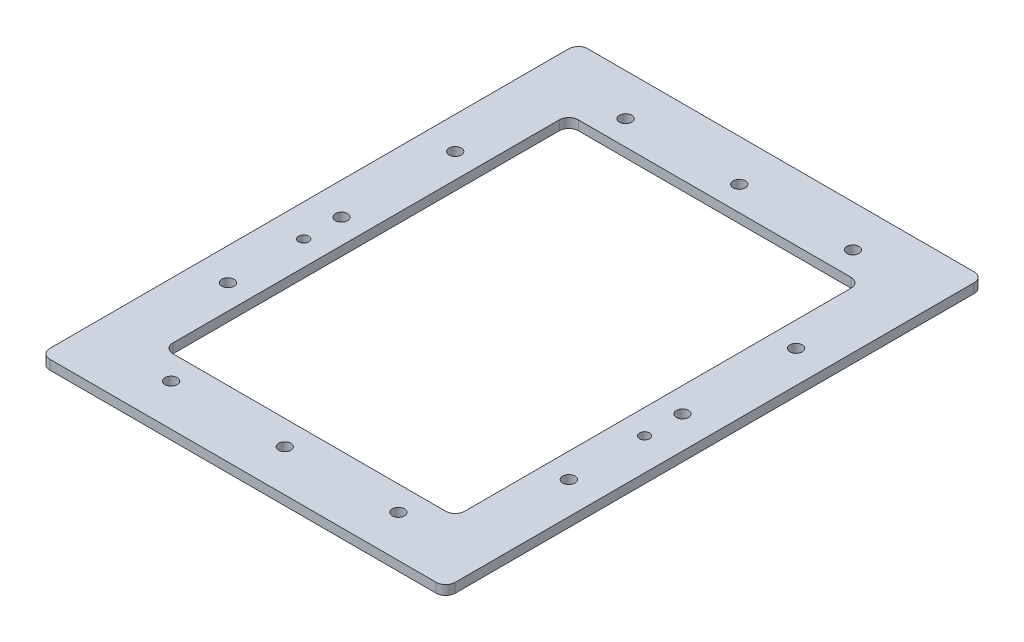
ISO-10303-21;
HEADER;
FILE_DESCRIPTION(('STEP AP214'),'2;1');
FILE_NAME('part.step','',(''),(''),'','','');
FILE_SCHEMA(('AUTOMOTIVE_DESIGN { 1 0 10303 214 1 1 1 1 }'));
ENDSEC;
DATA;
#1=APPLICATION_CONTEXT('core data for automotive mechanical design processes');
#2=APPLICATION_PROTOCOL_DEFINITION('international standard','automotive_design',2000,#1);
#3=PRODUCT_CONTEXT('',#1,'mechanical');
#4=PRODUCT('Part','Part','',(#3));
#5=PRODUCT_RELATED_PRODUCT_CATEGORY('part','',(#4));
#6=PRODUCT_DEFINITION_FORMATION('','',#4);
#7=PRODUCT_DEFINITION_CONTEXT('part definition',#1,'design');
#8=PRODUCT_DEFINITION('design','',#6,#7);
#9=PRODUCT_DEFINITION_SHAPE('','',#8);
#10=(LENGTH_UNIT() NAMED_UNIT(*) SI_UNIT(.MILLI.,.METRE.));
#11=(NAMED_UNIT(*) PLANE_ANGLE_UNIT() SI_UNIT($,.RADIAN.));
#12=(NAMED_UNIT(*) SI_UNIT($,.STERADIAN.) SOLID_ANGLE_UNIT());
#13=UNCERTAINTY_MEASURE_WITH_UNIT(LENGTH_MEASURE(1.E-05),#10,'distance_accuracy_value','');
#14=(GEOMETRIC_REPRESENTATION_CONTEXT(3) GLOBAL_UNCERTAINTY_ASSIGNED_CONTEXT((#13)) GLOBAL_UNIT_ASSIGNED_CONTEXT((#10,
#11,#12)) REPRESENTATION_CONTEXT('',''));
#15=CARTESIAN_POINT('',(0.,0.,0.));
#16=DIRECTION('',(0.,0.,1.));
#17=DIRECTION('',(1.,0.,0.));
#18=AXIS2_PLACEMENT_3D('',#15,#16,#17);
#19=CARTESIAN_POINT('',(135.89,-6.35,180.34));
#20=DIRECTION('',(1.,0.,0.));
#21=DIRECTION('',(0.,0.,-1.));
#22=AXIS2_PLACEMENT_3D('',#19,#20,#21);
#23=PLANE('',#22);
#24=DIRECTION('',(0.,0.,-1.));
#25=VECTOR('',#24,1.);
#26=CARTESIAN_POINT('',(135.89,0.,180.34));
#27=LINE('',#26,#25);
#28=CARTESIAN_POINT('',(135.89,0.,173.99));
#29=VERTEX_POINT('',#28);
#30=CARTESIAN_POINT('',(135.89,0.,-173.99));
#31=VERTEX_POINT('',#30);
#32=EDGE_CURVE('E228',#29,#31,#27,.T.);
#33=ORIENTED_EDGE('',*,*,#32,.F.);
#34=DIRECTION('',(0.,1.,0.));
#35=VECTOR('',#34,1.);
#36=CARTESIAN_POINT('',(135.89,-6.35,173.99));
#37=LINE('',#36,#35);
#38=CARTESIAN_POINT('',(135.89,-6.35,173.99));
#39=VERTEX_POINT('',#38);
#40=EDGE_CURVE('E305',#29,#39,#37,.F.);
#41=ORIENTED_EDGE('',*,*,#40,.T.);
#42=DIRECTION('',(0.,0.,-1.));
#43=VECTOR('',#42,1.);
#44=CARTESIAN_POINT('',(135.89,-6.35,180.34));
#45=LINE('',#44,#43);
#46=CARTESIAN_POINT('',(135.89,-6.35,-173.99));
#47=VERTEX_POINT('',#46);
#48=EDGE_CURVE('E212',#39,#47,#45,.T.);
#49=ORIENTED_EDGE('',*,*,#48,.T.);
#50=DIRECTION('',(0.,1.,0.));
#51=VECTOR('',#50,1.);
#52=CARTESIAN_POINT('',(135.89,-6.35,-173.99));
#53=LINE('',#52,#51);
#54=EDGE_CURVE('E301',#47,#31,#53,.T.);
#55=ORIENTED_EDGE('',*,*,#54,.T.);
#56=EDGE_LOOP('',(#33,#41,#49,#55));
#57=FACE_BOUND('',#56,.T.);
#58=ADVANCED_FACE('F44',(#57),#23,.T.);
#59=CARTESIAN_POINT('',(-135.89,-6.35,180.34));
#60=DIRECTION('',(0.,0.,1.));
#61=DIRECTION('',(1.,0.,0.));
#62=AXIS2_PLACEMENT_3D('',#59,#60,#61);
#63=PLANE('',#62);
#64=DIRECTION('',(1.,0.,0.));
#65=VECTOR('',#64,1.);
#66=CARTESIAN_POINT('',(-135.89,0.,180.34));
#67=LINE('',#66,#65);
#68=CARTESIAN_POINT('',(-129.54,0.,180.34));
#69=VERTEX_POINT('',#68);
#70=CARTESIAN_POINT('',(129.54,0.,180.34));
#71=VERTEX_POINT('',#70);
#72=EDGE_CURVE('E217',#69,#71,#67,.T.);
#73=ORIENTED_EDGE('',*,*,#72,.F.);
#74=DIRECTION('',(0.,1.,0.));
#75=VECTOR('',#74,1.);
#76=CARTESIAN_POINT('',(-129.54,-6.35,180.34));
#77=LINE('',#76,#75);
#78=CARTESIAN_POINT('',(-129.54,-6.35,180.34));
#79=VERTEX_POINT('',#78);
#80=EDGE_CURVE('E287',#69,#79,#77,.F.);
#81=ORIENTED_EDGE('',*,*,#80,.T.);
#82=DIRECTION('',(1.,0.,0.));
#83=VECTOR('',#82,1.);
#84=CARTESIAN_POINT('',(-135.89,-6.35,180.34));
#85=LINE('',#84,#83);
#86=CARTESIAN_POINT('',(129.54,-6.35,180.34));
#87=VERTEX_POINT('',#86);
#88=EDGE_CURVE('E224',#79,#87,#85,.T.);
#89=ORIENTED_EDGE('',*,*,#88,.T.);
#90=DIRECTION('',(0.,1.,0.));
#91=VECTOR('',#90,1.);
#92=CARTESIAN_POINT('',(129.54,-6.35,180.34));
#93=LINE('',#92,#91);
#94=EDGE_CURVE('E283',#87,#71,#93,.T.);
#95=ORIENTED_EDGE('',*,*,#94,.T.);
#96=EDGE_LOOP('',(#73,#81,#89,#95));
#97=FACE_BOUND('',#96,.T.);
#98=ADVANCED_FACE('F646',(#97),#63,.T.);
#99=CARTESIAN_POINT('',(-135.89,-6.35,180.34));
#100=DIRECTION('',(-1.,0.,0.));
#101=DIRECTION('',(0.,0.,1.));
#102=AXIS2_PLACEMENT_3D('',#99,#100,#101);
#103=PLANE('',#102);
#104=DIRECTION('',(0.,0.,1.));
#105=VECTOR('',#104,1.);
#106=CARTESIAN_POINT('',(-135.89,-6.35,180.34));
#107=LINE('',#106,#105);
#108=CARTESIAN_POINT('',(-135.89,-6.35,-173.99));
#109=VERTEX_POINT('',#108);
#110=CARTESIAN_POINT('',(-135.89,-6.35,173.99));
#111=VERTEX_POINT('',#110);
#112=EDGE_CURVE('E220',#109,#111,#107,.T.);
#113=ORIENTED_EDGE('',*,*,#112,.T.);
#114=DIRECTION('',(0.,1.,0.));
#115=VECTOR('',#114,1.);
#116=CARTESIAN_POINT('',(-135.89,-6.35,173.99));
#117=LINE('',#116,#115);
#118=CARTESIAN_POINT('',(-135.89,0.,173.99));
#119=VERTEX_POINT('',#118);
#120=EDGE_CURVE('E267',#111,#119,#117,.T.);
#121=ORIENTED_EDGE('',*,*,#120,.T.);
#122=DIRECTION('',(0.,0.,1.));
#123=VECTOR('',#122,1.);
#124=CARTESIAN_POINT('',(-135.89,0.,180.34));
#125=LINE('',#124,#123);
#126=CARTESIAN_POINT('',(-135.89,0.,-173.99));
#127=VERTEX_POINT('',#126);
#128=EDGE_CURVE('E236',#127,#119,#125,.T.);
#129=ORIENTED_EDGE('',*,*,#128,.F.);
#130=DIRECTION('',(0.,1.,0.));
#131=VECTOR('',#130,1.);
#132=CARTESIAN_POINT('',(-135.89,-6.35,-173.99));
#133=LINE('',#132,#131);
#134=EDGE_CURVE('E264',#127,#109,#133,.F.);
#135=ORIENTED_EDGE('',*,*,#134,.T.);
#136=EDGE_LOOP('',(#113,#121,#129,#135));
#137=FACE_BOUND('',#136,.T.);
#138=ADVANCED_FACE('F652',(#137),#103,.T.);
#139=CARTESIAN_POINT('',(-135.89,-6.35,-180.34));
#140=DIRECTION('',(0.,0.,-1.));
#141=DIRECTION('',(-1.,0.,0.));
#142=AXIS2_PLACEMENT_3D('',#139,#140,#141);
#143=PLANE('',#142);
#144=DIRECTION('',(-1.,0.,0.));
#145=VECTOR('',#144,1.);
#146=CARTESIAN_POINT('',(-135.89,0.,-180.34));
#147=LINE('',#146,#145);
#148=CARTESIAN_POINT('',(129.54,0.,-180.34));
#149=VERTEX_POINT('',#148);
#150=CARTESIAN_POINT('',(-129.54,0.,-180.34));
#151=VERTEX_POINT('',#150);
#152=EDGE_CURVE('E232',#149,#151,#147,.T.);
#153=ORIENTED_EDGE('',*,*,#152,.F.);
#154=DIRECTION('',(0.,1.,0.));
#155=VECTOR('',#154,1.);
#156=CARTESIAN_POINT('',(129.54,-6.35,-180.34));
#157=LINE('',#156,#155);
#158=CARTESIAN_POINT('',(129.54,-6.35,-180.34));
#159=VERTEX_POINT('',#158);
#160=EDGE_CURVE('E67',#149,#159,#157,.F.);
#161=ORIENTED_EDGE('',*,*,#160,.T.);
#162=DIRECTION('',(-1.,0.,0.));
#163=VECTOR('',#162,1.);
#164=CARTESIAN_POINT('',(-135.89,-6.35,-180.34));
#165=LINE('',#164,#163);
#166=CARTESIAN_POINT('',(-129.54,-6.35,-180.34));
#167=VERTEX_POINT('',#166);
#168=EDGE_CURVE('E216',#159,#167,#165,.T.);
#169=ORIENTED_EDGE('',*,*,#168,.T.);
#170=DIRECTION('',(0.,1.,0.));
#171=VECTOR('',#170,1.);
#172=CARTESIAN_POINT('',(-129.54,-6.35,-180.34));
#173=LINE('',#172,#171);
#174=EDGE_CURVE('E308',#167,#151,#173,.T.);
#175=ORIENTED_EDGE('',*,*,#174,.T.);
#176=EDGE_LOOP('',(#153,#161,#169,#175));
#177=FACE_BOUND('',#176,.T.);
#178=ADVANCED_FACE('F658',(#177),#143,.T.);
#179=CARTESIAN_POINT('',(0.,-6.35,0.));
#180=DIRECTION('',(0.,-1.,0.));
#181=DIRECTION('',(0.,0.,-1.));
#182=AXIS2_PLACEMENT_3D('',#179,#180,#181);
#183=PLANE('',#182);
#184=CARTESIAN_POINT('',(-114.3,-6.35,25.4));
#185=DIRECTION('',(0.,1.,0.));
#186=DIRECTION('',(0.,0.,1.));
#187=AXIS2_PLACEMENT_3D('',#184,#185,#186);
#188=CIRCLE('',#187,3.3782);
#189=CARTESIAN_POINT('',(-114.3,-6.35,28.7782));
#190=VERTEX_POINT('',#189);
#191=EDGE_CURVE('E583',#190,#190,#188,.T.);
#192=ORIENTED_EDGE('',*,*,#191,.T.);
#193=EDGE_LOOP('',(#192));
#194=FACE_BOUND('',#193,.T.);
#195=CARTESIAN_POINT('',(114.3,-6.35,25.4));
#196=DIRECTION('',(0.,1.,0.));
#197=DIRECTION('',(0.,0.,1.));
#198=AXIS2_PLACEMENT_3D('',#195,#196,#197);
#199=CIRCLE('',#198,3.3782);
#200=CARTESIAN_POINT('',(114.3,-6.35,28.7782));
#201=VERTEX_POINT('',#200);
#202=EDGE_CURVE('E571',#201,#201,#199,.T.);
#203=ORIENTED_EDGE('',*,*,#202,.T.);
#204=EDGE_LOOP('',(#203));
#205=FACE_BOUND('',#204,.T.);
#206=CARTESIAN_POINT('',(-76.2,-6.35,-152.4));
#207=DIRECTION('',(0.,1.,0.));
#208=DIRECTION('',(0.,0.,1.));
#209=AXIS2_PLACEMENT_3D('',#206,#207,#208);
#210=CIRCLE('',#209,4.1021);
#211=CARTESIAN_POINT('',(-76.2,-6.35,-148.2979));
#212=VERTEX_POINT('',#211);
#213=EDGE_CURVE('E559',#212,#212,#210,.T.);
#214=ORIENTED_EDGE('',*,*,#213,.T.);
#215=EDGE_LOOP('',(#214));
#216=FACE_BOUND('',#215,.T.);
#217=CARTESIAN_POINT('',(76.2,-6.35,-152.4));
#218=DIRECTION('',(0.,1.,0.));
#219=DIRECTION('',(0.,0.,1.));
#220=AXIS2_PLACEMENT_3D('',#217,#218,#219);
#221=CIRCLE('',#220,4.1021);
#222=CARTESIAN_POINT('',(76.2,-6.35,-148.2979));
#223=VERTEX_POINT('',#222);
#224=EDGE_CURVE('E547',#223,#223,#221,.T.);
#225=ORIENTED_EDGE('',*,*,#224,.T.);
#226=EDGE_LOOP('',(#225));
#227=FACE_BOUND('',#226,.T.);
#228=CARTESIAN_POINT('',(0.,-6.35,-152.4));
#229=DIRECTION('',(0.,1.,0.));
#230=DIRECTION('',(0.,0.,1.));
#231=AXIS2_PLACEMENT_3D('',#228,#229,#230);
#232=CIRCLE('',#231,4.1021);
#233=CARTESIAN_POINT('',(0.,-6.35,-148.2979));
#234=VERTEX_POINT('',#233);
#235=EDGE_CURVE('E535',#234,#234,#232,.T.);
#236=ORIENTED_EDGE('',*,*,#235,.T.);
#237=EDGE_LOOP('',(#236));
#238=FACE_BOUND('',#237,.T.);
#239=CARTESIAN_POINT('',(114.3,-6.35,0.));
#240=DIRECTION('',(0.,1.,0.));
#241=DIRECTION('',(0.,0.,1.));
#242=AXIS2_PLACEMENT_3D('',#239,#240,#241);
#243=CIRCLE('',#242,4.1021);
#244=CARTESIAN_POINT('',(114.3,-6.35,4.1021));
#245=VERTEX_POINT('',#244);
#246=EDGE_CURVE('E523',#245,#245,#243,.T.);
#247=ORIENTED_EDGE('',*,*,#246,.T.);
#248=EDGE_LOOP('',(#247));
#249=FACE_BOUND('',#248,.T.);
#250=CARTESIAN_POINT('',(114.3,-6.35,-76.2));
#251=DIRECTION('',(0.,1.,0.));
#252=DIRECTION('',(0.,0.,1.));
#253=AXIS2_PLACEMENT_3D('',#250,#251,#252);
#254=CIRCLE('',#253,4.1021);
#255=CARTESIAN_POINT('',(114.3,-6.35,-72.0979));
#256=VERTEX_POINT('',#255);
#257=EDGE_CURVE('E511',#256,#256,#254,.T.);
#258=ORIENTED_EDGE('',*,*,#257,.T.);
#259=EDGE_LOOP('',(#258));
#260=FACE_BOUND('',#259,.T.);
#261=CARTESIAN_POINT('',(114.3,-6.35,76.2));
#262=DIRECTION('',(0.,1.,0.));
#263=DIRECTION('',(0.,0.,1.));
#264=AXIS2_PLACEMENT_3D('',#261,#262,#263);
#265=CIRCLE('',#264,4.1021);
#266=CARTESIAN_POINT('',(114.3,-6.35,80.3021));
#267=VERTEX_POINT('',#266);
#268=EDGE_CURVE('E499',#267,#267,#265,.T.);
#269=ORIENTED_EDGE('',*,*,#268,.T.);
#270=EDGE_LOOP('',(#269));
#271=FACE_BOUND('',#270,.T.);
#272=CARTESIAN_POINT('',(-114.3,-6.35,0.));
#273=DIRECTION('',(0.,1.,0.));
#274=DIRECTION('',(0.,0.,1.));
#275=AXIS2_PLACEMENT_3D('',#272,#273,#274);
#276=CIRCLE('',#275,4.1021);
#277=CARTESIAN_POINT('',(-114.3,-6.35,4.10209999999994));
#278=VERTEX_POINT('',#277);
#279=EDGE_CURVE('E487',#278,#278,#276,.T.);
#280=ORIENTED_EDGE('',*,*,#279,.T.);
#281=EDGE_LOOP('',(#280));
#282=FACE_BOUND('',#281,.T.);
#283=CARTESIAN_POINT('',(-114.3,-6.35,-76.2));
#284=DIRECTION('',(0.,1.,0.));
#285=DIRECTION('',(0.,0.,1.));
#286=AXIS2_PLACEMENT_3D('',#283,#284,#285);
#287=CIRCLE('',#286,4.1021);
#288=CARTESIAN_POINT('',(-114.3,-6.35,-72.0979));
#289=VERTEX_POINT('',#288);
#290=EDGE_CURVE('E475',#289,#289,#287,.T.);
#291=ORIENTED_EDGE('',*,*,#290,.T.);
#292=EDGE_LOOP('',(#291));
#293=FACE_BOUND('',#292,.T.);
#294=CARTESIAN_POINT('',(-114.3,-6.35,76.2));
#295=DIRECTION('',(0.,1.,0.));
#296=DIRECTION('',(0.,0.,1.));
#297=AXIS2_PLACEMENT_3D('',#294,#295,#296);
#298=CIRCLE('',#297,4.1021);
#299=CARTESIAN_POINT('',(-114.3,-6.35,80.3021));
#300=VERTEX_POINT('',#299);
#301=EDGE_CURVE('E464',#300,#300,#298,.T.);
#302=ORIENTED_EDGE('',*,*,#301,.T.);
#303=EDGE_LOOP('',(#302));
#304=FACE_BOUND('',#303,.T.);
#305=CARTESIAN_POINT('',(0.,-6.35,152.4));
#306=DIRECTION('',(0.,1.,0.));
#307=DIRECTION('',(0.,0.,1.));
#308=AXIS2_PLACEMENT_3D('',#305,#306,#307);
#309=CIRCLE('',#308,4.1021);
#310=CARTESIAN_POINT('',(0.,-6.35,156.5021));
#311=VERTEX_POINT('',#310);
#312=EDGE_CURVE('E452',#311,#311,#309,.T.);
#313=ORIENTED_EDGE('',*,*,#312,.T.);
#314=EDGE_LOOP('',(#313));
#315=FACE_BOUND('',#314,.T.);
#316=CARTESIAN_POINT('',(-76.2,-6.35,152.4));
#317=DIRECTION('',(0.,1.,0.));
#318=DIRECTION('',(0.,0.,1.));
#319=AXIS2_PLACEMENT_3D('',#316,#317,#318);
#320=CIRCLE('',#319,4.1021);
#321=CARTESIAN_POINT('',(-76.2,-6.35,156.5021));
#322=VERTEX_POINT('',#321);
#323=EDGE_CURVE('E440',#322,#322,#320,.T.);
#324=ORIENTED_EDGE('',*,*,#323,.T.);
#325=EDGE_LOOP('',(#324));
#326=FACE_BOUND('',#325,.T.);
#327=CARTESIAN_POINT('',(76.2,-6.35,152.4));
#328=DIRECTION('',(0.,1.,0.));
#329=DIRECTION('',(0.,0.,1.));
#330=AXIS2_PLACEMENT_3D('',#327,#328,#329);
#331=CIRCLE('',#330,4.1021);
#332=CARTESIAN_POINT('',(76.2,-6.35,156.5021));
#333=VERTEX_POINT('',#332);
#334=EDGE_CURVE('E189',#333,#333,#331,.T.);
#335=ORIENTED_EDGE('',*,*,#334,.T.);
#336=EDGE_LOOP('',(#335));
#337=FACE_BOUND('',#336,.T.);
#338=DIRECTION('',(1.,0.,0.));
#339=VECTOR('',#338,1.);
#340=CARTESIAN_POINT('',(-97.79,-6.35,135.89));
#341=LINE('',#340,#339);
#342=CARTESIAN_POINT('',(-91.4400000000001,-6.35,135.89));
#343=VERTEX_POINT('',#342);
#344=CARTESIAN_POINT('',(91.4400000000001,-6.35,135.89));
#345=VERTEX_POINT('',#344);
#346=EDGE_CURVE('E203',#343,#345,#341,.T.);
#347=ORIENTED_EDGE('',*,*,#346,.T.);
#348=CARTESIAN_POINT('',(91.4400000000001,-6.35,129.54));
#349=DIRECTION('',(0.,-1.,0.));
#350=DIRECTION('',(0.,0.,-1.));
#351=AXIS2_PLACEMENT_3D('',#348,#349,#350);
#352=CIRCLE('',#351,6.35);
#353=CARTESIAN_POINT('',(97.7900000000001,-6.35,129.54));
#354=VERTEX_POINT('',#353);
#355=EDGE_CURVE('E170',#345,#354,#352,.F.);
#356=ORIENTED_EDGE('',*,*,#355,.T.);
#357=DIRECTION('',(0.,0.,-1.));
#358=VECTOR('',#357,1.);
#359=CARTESIAN_POINT('',(97.7900000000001,-6.35,135.89));
#360=LINE('',#359,#358);
#361=CARTESIAN_POINT('',(97.7900000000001,-6.35,-129.54));
#362=VERTEX_POINT('',#361);
#363=EDGE_CURVE('E179',#354,#362,#360,.T.);
#364=ORIENTED_EDGE('',*,*,#363,.T.);
#365=CARTESIAN_POINT('',(91.4400000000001,-6.35,-129.54));
#366=DIRECTION('',(0.,-1.,0.));
#367=DIRECTION('',(0.,0.,-1.));
#368=AXIS2_PLACEMENT_3D('',#365,#366,#367);
#369=CIRCLE('',#368,6.35);
#370=CARTESIAN_POINT('',(91.4400000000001,-6.35,-135.89));
#371=VERTEX_POINT('',#370);
#372=EDGE_CURVE('E11',#362,#371,#369,.F.);
#373=ORIENTED_EDGE('',*,*,#372,.T.);
#374=DIRECTION('',(-1.,0.,0.));
#375=VECTOR('',#374,1.);
#376=CARTESIAN_POINT('',(-97.7900000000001,-6.35,-135.89));
#377=LINE('',#376,#375);
#378=CARTESIAN_POINT('',(-91.4400000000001,-6.35,-135.89));
#379=VERTEX_POINT('',#378);
#380=EDGE_CURVE('E418',#371,#379,#377,.T.);
#381=ORIENTED_EDGE('',*,*,#380,.T.);
#382=CARTESIAN_POINT('',(-91.4400000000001,-6.35,-129.54));
#383=DIRECTION('',(0.,-1.,0.));
#384=DIRECTION('',(0.,0.,-1.));
#385=AXIS2_PLACEMENT_3D('',#382,#383,#384);
#386=CIRCLE('',#385,6.35);
#387=CARTESIAN_POINT('',(-97.7900000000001,-6.35,-129.54));
#388=VERTEX_POINT('',#387);
#389=EDGE_CURVE('E325',#379,#388,#386,.F.);
#390=ORIENTED_EDGE('',*,*,#389,.T.);
#391=DIRECTION('',(0.,0.,1.));
#392=VECTOR('',#391,1.);
#393=CARTESIAN_POINT('',(-97.79,-6.35,135.89));
#394=LINE('',#393,#392);
#395=CARTESIAN_POINT('',(-97.79,-6.35,129.54));
#396=VERTEX_POINT('',#395);
#397=EDGE_CURVE('E413',#388,#396,#394,.T.);
#398=ORIENTED_EDGE('',*,*,#397,.T.);
#399=CARTESIAN_POINT('',(-91.4400000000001,-6.35,129.54));
#400=DIRECTION('',(0.,-1.,0.));
#401=DIRECTION('',(0.,0.,-1.));
#402=AXIS2_PLACEMENT_3D('',#399,#400,#401);
#403=CIRCLE('',#402,6.35);
#404=EDGE_CURVE('E319',#396,#343,#403,.F.);
#405=ORIENTED_EDGE('',*,*,#404,.T.);
#406=EDGE_LOOP('',(#347,#356,#364,#373,#381,#390,#398,#405));
#407=FACE_BOUND('',#406,.T.);
#408=ORIENTED_EDGE('',*,*,#88,.F.);
#409=CARTESIAN_POINT('',(-129.54,-6.35,173.99));
#410=DIRECTION('',(0.,-1.,0.));
#411=DIRECTION('',(0.,0.,-1.));
#412=AXIS2_PLACEMENT_3D('',#409,#410,#411);
#413=CIRCLE('',#412,6.35);
#414=EDGE_CURVE('E298',#79,#111,#413,.T.);
#415=ORIENTED_EDGE('',*,*,#414,.T.);
#416=ORIENTED_EDGE('',*,*,#112,.F.);
#417=CARTESIAN_POINT('',(-129.54,-6.35,-173.99));
#418=DIRECTION('',(0.,-1.,0.));
#419=DIRECTION('',(0.,0.,-1.));
#420=AXIS2_PLACEMENT_3D('',#417,#418,#419);
#421=CIRCLE('',#420,6.35);
#422=EDGE_CURVE('E60',#109,#167,#421,.T.);
#423=ORIENTED_EDGE('',*,*,#422,.T.);
#424=ORIENTED_EDGE('',*,*,#168,.F.);
#425=CARTESIAN_POINT('',(129.54,-6.35,-173.99));
#426=DIRECTION('',(0.,-1.,0.));
#427=DIRECTION('',(0.,0.,-1.));
#428=AXIS2_PLACEMENT_3D('',#425,#426,#427);
#429=CIRCLE('',#428,6.35);
#430=EDGE_CURVE('E292',#159,#47,#429,.T.);
#431=ORIENTED_EDGE('',*,*,#430,.T.);
#432=ORIENTED_EDGE('',*,*,#48,.F.);
#433=CARTESIAN_POINT('',(129.54,-6.35,173.99));
#434=DIRECTION('',(0.,-1.,0.));
#435=DIRECTION('',(0.,0.,-1.));
#436=AXIS2_PLACEMENT_3D('',#433,#434,#435);
#437=CIRCLE('',#436,6.35);
#438=EDGE_CURVE('E295',#39,#87,#437,.T.);
#439=ORIENTED_EDGE('',*,*,#438,.T.);
#440=EDGE_LOOP('',(#408,#415,#416,#423,#424,#431,#432,#439));
#441=FACE_BOUND('',#440,.T.);
#442=ADVANCED_FACE('F601',(#194,#205,#216,#227,#238,#249,#260,#271,#282,#293,#304,#315,#326,
#337,#407,#441),#183,.T.);
#443=CARTESIAN_POINT('',(0.,0.,0.));
#444=DIRECTION('',(0.,-1.,0.));
#445=DIRECTION('',(0.,0.,-1.));
#446=AXIS2_PLACEMENT_3D('',#443,#444,#445);
#447=PLANE('',#446);
#448=CARTESIAN_POINT('',(-114.3,0.,25.4));
#449=DIRECTION('',(0.,1.,0.));
#450=DIRECTION('',(0.,0.,1.));
#451=AXIS2_PLACEMENT_3D('',#448,#449,#450);
#452=CIRCLE('',#451,3.3782);
#453=CARTESIAN_POINT('',(-114.3,0.,28.7782));
#454=VERTEX_POINT('',#453);
#455=EDGE_CURVE('E589',#454,#454,#452,.T.);
#456=ORIENTED_EDGE('',*,*,#455,.F.);
#457=EDGE_LOOP('',(#456));
#458=FACE_BOUND('',#457,.T.);
#459=CARTESIAN_POINT('',(114.3,0.,25.4));
#460=DIRECTION('',(0.,1.,0.));
#461=DIRECTION('',(0.,0.,1.));
#462=AXIS2_PLACEMENT_3D('',#459,#460,#461);
#463=CIRCLE('',#462,3.3782);
#464=CARTESIAN_POINT('',(114.3,0.,28.7782));
#465=VERTEX_POINT('',#464);
#466=EDGE_CURVE('E577',#465,#465,#463,.T.);
#467=ORIENTED_EDGE('',*,*,#466,.F.);
#468=EDGE_LOOP('',(#467));
#469=FACE_BOUND('',#468,.T.);
#470=CARTESIAN_POINT('',(-76.2,0.,-152.4));
#471=DIRECTION('',(0.,1.,0.));
#472=DIRECTION('',(0.,0.,1.));
#473=AXIS2_PLACEMENT_3D('',#470,#471,#472);
#474=CIRCLE('',#473,4.1021);
#475=CARTESIAN_POINT('',(-76.2,0.,-148.2979));
#476=VERTEX_POINT('',#475);
#477=EDGE_CURVE('E565',#476,#476,#474,.T.);
#478=ORIENTED_EDGE('',*,*,#477,.F.);
#479=EDGE_LOOP('',(#478));
#480=FACE_BOUND('',#479,.T.);
#481=CARTESIAN_POINT('',(76.2,0.,-152.4));
#482=DIRECTION('',(0.,1.,0.));
#483=DIRECTION('',(0.,0.,1.));
#484=AXIS2_PLACEMENT_3D('',#481,#482,#483);
#485=CIRCLE('',#484,4.1021);
#486=CARTESIAN_POINT('',(76.2,0.,-148.2979));
#487=VERTEX_POINT('',#486);
#488=EDGE_CURVE('E553',#487,#487,#485,.T.);
#489=ORIENTED_EDGE('',*,*,#488,.F.);
#490=EDGE_LOOP('',(#489));
#491=FACE_BOUND('',#490,.T.);
#492=CARTESIAN_POINT('',(0.,0.,-152.4));
#493=DIRECTION('',(0.,1.,0.));
#494=DIRECTION('',(0.,0.,1.));
#495=AXIS2_PLACEMENT_3D('',#492,#493,#494);
#496=CIRCLE('',#495,4.1021);
#497=CARTESIAN_POINT('',(0.,0.,-148.2979));
#498=VERTEX_POINT('',#497);
#499=EDGE_CURVE('E541',#498,#498,#496,.T.);
#500=ORIENTED_EDGE('',*,*,#499,.F.);
#501=EDGE_LOOP('',(#500));
#502=FACE_BOUND('',#501,.T.);
#503=CARTESIAN_POINT('',(114.3,0.,0.));
#504=DIRECTION('',(0.,1.,0.));
#505=DIRECTION('',(0.,0.,1.));
#506=AXIS2_PLACEMENT_3D('',#503,#504,#505);
#507=CIRCLE('',#506,4.1021);
#508=CARTESIAN_POINT('',(114.3,0.,4.1021));
#509=VERTEX_POINT('',#508);
#510=EDGE_CURVE('E529',#509,#509,#507,.T.);
#511=ORIENTED_EDGE('',*,*,#510,.F.);
#512=EDGE_LOOP('',(#511));
#513=FACE_BOUND('',#512,.T.);
#514=CARTESIAN_POINT('',(114.3,0.,-76.2));
#515=DIRECTION('',(0.,1.,0.));
#516=DIRECTION('',(0.,0.,1.));
#517=AXIS2_PLACEMENT_3D('',#514,#515,#516);
#518=CIRCLE('',#517,4.1021);
#519=CARTESIAN_POINT('',(114.3,0.,-72.0979));
#520=VERTEX_POINT('',#519);
#521=EDGE_CURVE('E517',#520,#520,#518,.T.);
#522=ORIENTED_EDGE('',*,*,#521,.F.);
#523=EDGE_LOOP('',(#522));
#524=FACE_BOUND('',#523,.T.);
#525=CARTESIAN_POINT('',(114.3,0.,76.2));
#526=DIRECTION('',(0.,1.,0.));
#527=DIRECTION('',(0.,0.,1.));
#528=AXIS2_PLACEMENT_3D('',#525,#526,#527);
#529=CIRCLE('',#528,4.1021);
#530=CARTESIAN_POINT('',(114.3,0.,80.3021));
#531=VERTEX_POINT('',#530);
#532=EDGE_CURVE('E505',#531,#531,#529,.T.);
#533=ORIENTED_EDGE('',*,*,#532,.F.);
#534=EDGE_LOOP('',(#533));
#535=FACE_BOUND('',#534,.T.);
#536=CARTESIAN_POINT('',(-114.3,0.,0.));
#537=DIRECTION('',(0.,1.,0.));
#538=DIRECTION('',(0.,0.,1.));
#539=AXIS2_PLACEMENT_3D('',#536,#537,#538);
#540=CIRCLE('',#539,4.1021);
#541=CARTESIAN_POINT('',(-114.3,0.,4.10209999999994));
#542=VERTEX_POINT('',#541);
#543=EDGE_CURVE('E493',#542,#542,#540,.T.);
#544=ORIENTED_EDGE('',*,*,#543,.F.);
#545=EDGE_LOOP('',(#544));
#546=FACE_BOUND('',#545,.T.);
#547=CARTESIAN_POINT('',(-114.3,0.,-76.2));
#548=DIRECTION('',(0.,1.,0.));
#549=DIRECTION('',(0.,0.,1.));
#550=AXIS2_PLACEMENT_3D('',#547,#548,#549);
#551=CIRCLE('',#550,4.1021);
#552=CARTESIAN_POINT('',(-114.3,0.,-72.0979));
#553=VERTEX_POINT('',#552);
#554=EDGE_CURVE('E481',#553,#553,#551,.T.);
#555=ORIENTED_EDGE('',*,*,#554,.F.);
#556=EDGE_LOOP('',(#555));
#557=FACE_BOUND('',#556,.T.);
#558=CARTESIAN_POINT('',(-114.3,0.,76.2));
#559=DIRECTION('',(0.,1.,0.));
#560=DIRECTION('',(0.,0.,1.));
#561=AXIS2_PLACEMENT_3D('',#558,#559,#560);
#562=CIRCLE('',#561,4.1021);
#563=CARTESIAN_POINT('',(-114.3,0.,80.3021));
#564=VERTEX_POINT('',#563);
#565=EDGE_CURVE('E469',#564,#564,#562,.T.);
#566=ORIENTED_EDGE('',*,*,#565,.F.);
#567=EDGE_LOOP('',(#566));
#568=FACE_BOUND('',#567,.T.);
#569=CARTESIAN_POINT('',(0.,0.,152.4));
#570=DIRECTION('',(0.,1.,0.));
#571=DIRECTION('',(0.,0.,1.));
#572=AXIS2_PLACEMENT_3D('',#569,#570,#571);
#573=CIRCLE('',#572,4.1021);
#574=CARTESIAN_POINT('',(0.,0.,156.5021));
#575=VERTEX_POINT('',#574);
#576=EDGE_CURVE('E458',#575,#575,#573,.T.);
#577=ORIENTED_EDGE('',*,*,#576,.F.);
#578=EDGE_LOOP('',(#577));
#579=FACE_BOUND('',#578,.T.);
#580=CARTESIAN_POINT('',(-76.2,0.,152.4));
#581=DIRECTION('',(0.,1.,0.));
#582=DIRECTION('',(0.,0.,1.));
#583=AXIS2_PLACEMENT_3D('',#580,#581,#582);
#584=CIRCLE('',#583,4.1021);
#585=CARTESIAN_POINT('',(-76.2,0.,156.5021));
#586=VERTEX_POINT('',#585);
#587=EDGE_CURVE('E446',#586,#586,#584,.T.);
#588=ORIENTED_EDGE('',*,*,#587,.F.);
#589=EDGE_LOOP('',(#588));
#590=FACE_BOUND('',#589,.T.);
#591=CARTESIAN_POINT('',(76.2,0.,152.4));
#592=DIRECTION('',(0.,1.,0.));
#593=DIRECTION('',(0.,0.,1.));
#594=AXIS2_PLACEMENT_3D('',#591,#592,#593);
#595=CIRCLE('',#594,4.1021);
#596=CARTESIAN_POINT('',(76.2,0.,156.5021));
#597=VERTEX_POINT('',#596);
#598=EDGE_CURVE('E200',#597,#597,#595,.T.);
#599=ORIENTED_EDGE('',*,*,#598,.F.);
#600=EDGE_LOOP('',(#599));
#601=FACE_BOUND('',#600,.T.);
#602=DIRECTION('',(-1.,0.,0.));
#603=VECTOR('',#602,1.);
#604=CARTESIAN_POINT('',(-97.7900000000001,0.,-135.89));
#605=LINE('',#604,#603);
#606=CARTESIAN_POINT('',(91.4400000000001,0.,-135.89));
#607=VERTEX_POINT('',#606);
#608=CARTESIAN_POINT('',(-91.4400000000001,0.,-135.89));
#609=VERTEX_POINT('',#608);
#610=EDGE_CURVE('E188',#607,#609,#605,.T.);
#611=ORIENTED_EDGE('',*,*,#610,.F.);
#612=CARTESIAN_POINT('',(91.4400000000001,0.,-129.54));
#613=DIRECTION('',(0.,-1.,0.));
#614=DIRECTION('',(0.,0.,-1.));
#615=AXIS2_PLACEMENT_3D('',#612,#613,#614);
#616=CIRCLE('',#615,6.35);
#617=CARTESIAN_POINT('',(97.7900000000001,0.,-129.54));
#618=VERTEX_POINT('',#617);
#619=EDGE_CURVE('E53',#607,#618,#616,.T.);
#620=ORIENTED_EDGE('',*,*,#619,.T.);
#621=DIRECTION('',(0.,0.,-1.));
#622=VECTOR('',#621,1.);
#623=CARTESIAN_POINT('',(97.7900000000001,0.,135.89));
#624=LINE('',#623,#622);
#625=CARTESIAN_POINT('',(97.7900000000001,0.,129.54));
#626=VERTEX_POINT('',#625);
#627=EDGE_CURVE('E176',#626,#618,#624,.T.);
#628=ORIENTED_EDGE('',*,*,#627,.F.);
#629=CARTESIAN_POINT('',(91.4400000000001,0.,129.54));
#630=DIRECTION('',(0.,-1.,0.));
#631=DIRECTION('',(0.,0.,-1.));
#632=AXIS2_PLACEMENT_3D('',#629,#630,#631);
#633=CIRCLE('',#632,6.35);
#634=CARTESIAN_POINT('',(91.4400000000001,0.,135.89));
#635=VERTEX_POINT('',#634);
#636=EDGE_CURVE('E159',#626,#635,#633,.T.);
#637=ORIENTED_EDGE('',*,*,#636,.T.);
#638=DIRECTION('',(1.,0.,0.));
#639=VECTOR('',#638,1.);
#640=CARTESIAN_POINT('',(-97.79,0.,135.89));
#641=LINE('',#640,#639);
#642=CARTESIAN_POINT('',(-91.4400000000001,0.,135.89));
#643=VERTEX_POINT('',#642);
#644=EDGE_CURVE('E209',#643,#635,#641,.T.);
#645=ORIENTED_EDGE('',*,*,#644,.F.);
#646=CARTESIAN_POINT('',(-91.4400000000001,0.,129.54));
#647=DIRECTION('',(0.,-1.,0.));
#648=DIRECTION('',(0.,0.,-1.));
#649=AXIS2_PLACEMENT_3D('',#646,#647,#648);
#650=CIRCLE('',#649,6.35);
#651=CARTESIAN_POINT('',(-97.79,0.,129.54));
#652=VERTEX_POINT('',#651);
#653=EDGE_CURVE('E316',#643,#652,#650,.T.);
#654=ORIENTED_EDGE('',*,*,#653,.T.);
#655=DIRECTION('',(0.,0.,1.));
#656=VECTOR('',#655,1.);
#657=CARTESIAN_POINT('',(-97.79,0.,135.89));
#658=LINE('',#657,#656);
#659=CARTESIAN_POINT('',(-97.7900000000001,0.,-129.54));
#660=VERTEX_POINT('',#659);
#661=EDGE_CURVE('E196',#660,#652,#658,.T.);
#662=ORIENTED_EDGE('',*,*,#661,.F.);
#663=CARTESIAN_POINT('',(-91.4400000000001,0.,-129.54));
#664=DIRECTION('',(0.,-1.,0.));
#665=DIRECTION('',(0.,0.,-1.));
#666=AXIS2_PLACEMENT_3D('',#663,#664,#665);
#667=CIRCLE('',#666,6.35);
#668=EDGE_CURVE('E322',#660,#609,#667,.T.);
#669=ORIENTED_EDGE('',*,*,#668,.T.);
#670=EDGE_LOOP('',(#611,#620,#628,#637,#645,#654,#662,#669));
#671=FACE_BOUND('',#670,.T.);
#672=ORIENTED_EDGE('',*,*,#128,.T.);
#673=CARTESIAN_POINT('',(-129.54,0.,173.99));
#674=DIRECTION('',(0.,-1.,0.));
#675=DIRECTION('',(0.,0.,-1.));
#676=AXIS2_PLACEMENT_3D('',#673,#674,#675);
#677=CIRCLE('',#676,6.35);
#678=EDGE_CURVE('E280',#119,#69,#677,.F.);
#679=ORIENTED_EDGE('',*,*,#678,.T.);
#680=ORIENTED_EDGE('',*,*,#72,.T.);
#681=CARTESIAN_POINT('',(129.54,0.,173.99));
#682=DIRECTION('',(0.,-1.,0.));
#683=DIRECTION('',(0.,0.,-1.));
#684=AXIS2_PLACEMENT_3D('',#681,#682,#683);
#685=CIRCLE('',#684,6.35);
#686=EDGE_CURVE('E277',#71,#29,#685,.F.);
#687=ORIENTED_EDGE('',*,*,#686,.T.);
#688=ORIENTED_EDGE('',*,*,#32,.T.);
#689=CARTESIAN_POINT('',(129.54,0.,-173.99));
#690=DIRECTION('',(0.,-1.,0.));
#691=DIRECTION('',(0.,0.,-1.));
#692=AXIS2_PLACEMENT_3D('',#689,#690,#691);
#693=CIRCLE('',#692,6.35);
#694=EDGE_CURVE('E274',#31,#149,#693,.F.);
#695=ORIENTED_EDGE('',*,*,#694,.T.);
#696=ORIENTED_EDGE('',*,*,#152,.T.);
#697=CARTESIAN_POINT('',(-129.54,0.,-173.99));
#698=DIRECTION('',(0.,-1.,0.));
#699=DIRECTION('',(0.,0.,-1.));
#700=AXIS2_PLACEMENT_3D('',#697,#698,#699);
#701=CIRCLE('',#700,6.35);
#702=EDGE_CURVE('E271',#151,#127,#701,.F.);
#703=ORIENTED_EDGE('',*,*,#702,.T.);
#704=EDGE_LOOP('',(#672,#679,#680,#687,#688,#695,#696,#703));
#705=FACE_BOUND('',#704,.T.);
#706=ADVANCED_FACE('F185',(#458,#469,#480,#491,#502,#513,#524,#535,#546,#557,#568,#579,#590,
#601,#671,#705),#447,.F.);
#707=CARTESIAN_POINT('',(97.7900000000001,-6.35,135.89));
#708=DIRECTION('',(1.,0.,0.));
#709=DIRECTION('',(0.,0.,-1.));
#710=AXIS2_PLACEMENT_3D('',#707,#708,#709);
#711=PLANE('',#710);
#712=ORIENTED_EDGE('',*,*,#363,.F.);
#713=DIRECTION('',(0.,1.,0.));
#714=VECTOR('',#713,1.);
#715=CARTESIAN_POINT('',(97.7900000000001,0.,129.54));
#716=LINE('',#715,#714);
#717=EDGE_CURVE('E163',#354,#626,#716,.T.);
#718=ORIENTED_EDGE('',*,*,#717,.T.);
#719=ORIENTED_EDGE('',*,*,#627,.T.);
#720=DIRECTION('',(0.,1.,0.));
#721=VECTOR('',#720,1.);
#722=CARTESIAN_POINT('',(97.7900000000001,-6.35,-129.54));
#723=LINE('',#722,#721);
#724=EDGE_CURVE('E182',#618,#362,#723,.F.);
#725=ORIENTED_EDGE('',*,*,#724,.T.);
#726=EDGE_LOOP('',(#712,#718,#719,#725));
#727=FACE_BOUND('',#726,.T.);
#728=ADVANCED_FACE('F175',(#727),#711,.F.);
#729=CARTESIAN_POINT('',(-97.79,-6.35,135.89));
#730=DIRECTION('',(0.,0.,1.));
#731=DIRECTION('',(1.,0.,0.));
#732=AXIS2_PLACEMENT_3D('',#729,#730,#731);
#733=PLANE('',#732);
#734=ORIENTED_EDGE('',*,*,#644,.T.);
#735=DIRECTION('',(0.,1.,0.));
#736=VECTOR('',#735,1.);
#737=CARTESIAN_POINT('',(91.4400000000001,-6.35,135.89));
#738=LINE('',#737,#736);
#739=EDGE_CURVE('E164',#635,#345,#738,.F.);
#740=ORIENTED_EDGE('',*,*,#739,.T.);
#741=ORIENTED_EDGE('',*,*,#346,.F.);
#742=DIRECTION('',(0.,1.,0.));
#743=VECTOR('',#742,1.);
#744=CARTESIAN_POINT('',(-91.4400000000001,0.,135.89));
#745=LINE('',#744,#743);
#746=EDGE_CURVE('E181',#343,#643,#745,.T.);
#747=ORIENTED_EDGE('',*,*,#746,.T.);
#748=EDGE_LOOP('',(#734,#740,#741,#747));
#749=FACE_BOUND('',#748,.T.);
#750=ADVANCED_FACE('F713',(#749),#733,.F.);
#751=CARTESIAN_POINT('',(-97.79,-6.35,135.89));
#752=DIRECTION('',(-1.,0.,0.));
#753=DIRECTION('',(0.,0.,1.));
#754=AXIS2_PLACEMENT_3D('',#751,#752,#753);
#755=PLANE('',#754);
#756=ORIENTED_EDGE('',*,*,#661,.T.);
#757=DIRECTION('',(0.,1.,0.));
#758=VECTOR('',#757,1.);
#759=CARTESIAN_POINT('',(-97.79,-6.35,129.54));
#760=LINE('',#759,#758);
#761=EDGE_CURVE('E254',#652,#396,#760,.F.);
#762=ORIENTED_EDGE('',*,*,#761,.T.);
#763=ORIENTED_EDGE('',*,*,#397,.F.);
#764=DIRECTION('',(0.,1.,0.));
#765=VECTOR('',#764,1.);
#766=CARTESIAN_POINT('',(-97.7900000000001,0.,-129.54));
#767=LINE('',#766,#765);
#768=EDGE_CURVE('E250',#388,#660,#767,.T.);
#769=ORIENTED_EDGE('',*,*,#768,.T.);
#770=EDGE_LOOP('',(#756,#762,#763,#769));
#771=FACE_BOUND('',#770,.T.);
#772=ADVANCED_FACE('F716',(#771),#755,.F.);
#773=CARTESIAN_POINT('',(-97.7900000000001,-6.35,-135.89));
#774=DIRECTION('',(0.,0.,-1.));
#775=DIRECTION('',(-1.,0.,0.));
#776=AXIS2_PLACEMENT_3D('',#773,#774,#775);
#777=PLANE('',#776);
#778=ORIENTED_EDGE('',*,*,#610,.T.);
#779=DIRECTION('',(0.,1.,0.));
#780=VECTOR('',#779,1.);
#781=CARTESIAN_POINT('',(-91.4400000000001,-6.35,-135.89));
#782=LINE('',#781,#780);
#783=EDGE_CURVE('E261',#609,#379,#782,.F.);
#784=ORIENTED_EDGE('',*,*,#783,.T.);
#785=ORIENTED_EDGE('',*,*,#380,.F.);
#786=DIRECTION('',(0.,1.,0.));
#787=VECTOR('',#786,1.);
#788=CARTESIAN_POINT('',(91.4400000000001,0.,-135.89));
#789=LINE('',#788,#787);
#790=EDGE_CURVE('E257',#371,#607,#789,.T.);
#791=ORIENTED_EDGE('',*,*,#790,.T.);
#792=EDGE_LOOP('',(#778,#784,#785,#791));
#793=FACE_BOUND('',#792,.T.);
#794=ADVANCED_FACE('F663',(#793),#777,.F.);
#795=CARTESIAN_POINT('',(91.4400000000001,-6.35,129.54));
#796=DIRECTION('',(0.,-1.,0.));
#797=DIRECTION('',(0.,0.,-1.));
#798=AXIS2_PLACEMENT_3D('',#795,#796,#797);
#799=CYLINDRICAL_SURFACE('',#798,6.35);
#800=ORIENTED_EDGE('',*,*,#355,.F.);
#801=ORIENTED_EDGE('',*,*,#739,.F.);
#802=ORIENTED_EDGE('',*,*,#636,.F.);
#803=ORIENTED_EDGE('',*,*,#717,.F.);
#804=EDGE_LOOP('',(#800,#801,#802,#803));
#805=FACE_BOUND('',#804,.T.);
#806=ADVANCED_FACE('F162',(#805),#799,.F.);
#807=CARTESIAN_POINT('',(-91.4400000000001,-6.35,129.54));
#808=DIRECTION('',(0.,-1.,0.));
#809=DIRECTION('',(0.,0.,-1.));
#810=AXIS2_PLACEMENT_3D('',#807,#808,#809);
#811=CYLINDRICAL_SURFACE('',#810,6.35);
#812=ORIENTED_EDGE('',*,*,#404,.F.);
#813=ORIENTED_EDGE('',*,*,#761,.F.);
#814=ORIENTED_EDGE('',*,*,#653,.F.);
#815=ORIENTED_EDGE('',*,*,#746,.F.);
#816=EDGE_LOOP('',(#812,#813,#814,#815));
#817=FACE_BOUND('',#816,.T.);
#818=ADVANCED_FACE('F662',(#817),#811,.F.);
#819=CARTESIAN_POINT('',(-91.4400000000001,-6.35,-129.54));
#820=DIRECTION('',(0.,-1.,0.));
#821=DIRECTION('',(0.,0.,-1.));
#822=AXIS2_PLACEMENT_3D('',#819,#820,#821);
#823=CYLINDRICAL_SURFACE('',#822,6.35);
#824=ORIENTED_EDGE('',*,*,#389,.F.);
#825=ORIENTED_EDGE('',*,*,#783,.F.);
#826=ORIENTED_EDGE('',*,*,#668,.F.);
#827=ORIENTED_EDGE('',*,*,#768,.F.);
#828=EDGE_LOOP('',(#824,#825,#826,#827));
#829=FACE_BOUND('',#828,.T.);
#830=ADVANCED_FACE('F666',(#829),#823,.F.);
#831=CARTESIAN_POINT('',(91.4400000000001,-6.35,-129.54));
#832=DIRECTION('',(0.,-1.,0.));
#833=DIRECTION('',(0.,0.,-1.));
#834=AXIS2_PLACEMENT_3D('',#831,#832,#833);
#835=CYLINDRICAL_SURFACE('',#834,6.35);
#836=ORIENTED_EDGE('',*,*,#372,.F.);
#837=ORIENTED_EDGE('',*,*,#724,.F.);
#838=ORIENTED_EDGE('',*,*,#619,.F.);
#839=ORIENTED_EDGE('',*,*,#790,.F.);
#840=EDGE_LOOP('',(#836,#837,#838,#839));
#841=FACE_BOUND('',#840,.T.);
#842=ADVANCED_FACE('F670',(#841),#835,.F.);
#843=CARTESIAN_POINT('',(-129.54,-6.35,173.99));
#844=DIRECTION('',(0.,1.,0.));
#845=DIRECTION('',(0.,0.,1.));
#846=AXIS2_PLACEMENT_3D('',#843,#844,#845);
#847=CYLINDRICAL_SURFACE('',#846,6.35);
#848=ORIENTED_EDGE('',*,*,#414,.F.);
#849=ORIENTED_EDGE('',*,*,#80,.F.);
#850=ORIENTED_EDGE('',*,*,#678,.F.);
#851=ORIENTED_EDGE('',*,*,#120,.F.);
#852=EDGE_LOOP('',(#848,#849,#850,#851));
#853=FACE_BOUND('',#852,.T.);
#854=ADVANCED_FACE('F674',(#853),#847,.T.);
#855=CARTESIAN_POINT('',(129.54,-6.35,173.99));
#856=DIRECTION('',(0.,1.,0.));
#857=DIRECTION('',(0.,0.,1.));
#858=AXIS2_PLACEMENT_3D('',#855,#856,#857);
#859=CYLINDRICAL_SURFACE('',#858,6.35);
#860=ORIENTED_EDGE('',*,*,#438,.F.);
#861=ORIENTED_EDGE('',*,*,#40,.F.);
#862=ORIENTED_EDGE('',*,*,#686,.F.);
#863=ORIENTED_EDGE('',*,*,#94,.F.);
#864=EDGE_LOOP('',(#860,#861,#862,#863));
#865=FACE_BOUND('',#864,.T.);
#866=ADVANCED_FACE('F678',(#865),#859,.T.);
#867=CARTESIAN_POINT('',(129.54,-6.35,-173.99));
#868=DIRECTION('',(0.,1.,0.));
#869=DIRECTION('',(0.,0.,1.));
#870=AXIS2_PLACEMENT_3D('',#867,#868,#869);
#871=CYLINDRICAL_SURFACE('',#870,6.35);
#872=ORIENTED_EDGE('',*,*,#430,.F.);
#873=ORIENTED_EDGE('',*,*,#160,.F.);
#874=ORIENTED_EDGE('',*,*,#694,.F.);
#875=ORIENTED_EDGE('',*,*,#54,.F.);
#876=EDGE_LOOP('',(#872,#873,#874,#875));
#877=FACE_BOUND('',#876,.T.);
#878=ADVANCED_FACE('F641',(#877),#871,.T.);
#879=CARTESIAN_POINT('',(-129.54,-6.35,-173.99));
#880=DIRECTION('',(0.,1.,0.));
#881=DIRECTION('',(0.,0.,1.));
#882=AXIS2_PLACEMENT_3D('',#879,#880,#881);
#883=CYLINDRICAL_SURFACE('',#882,6.35);
#884=ORIENTED_EDGE('',*,*,#422,.F.);
#885=ORIENTED_EDGE('',*,*,#134,.F.);
#886=ORIENTED_EDGE('',*,*,#702,.F.);
#887=ORIENTED_EDGE('',*,*,#174,.F.);
#888=EDGE_LOOP('',(#884,#885,#886,#887));
#889=FACE_BOUND('',#888,.T.);
#890=ADVANCED_FACE('F46',(#889),#883,.T.);
#891=CARTESIAN_POINT('',(76.2,0.,152.4));
#892=DIRECTION('',(0.,1.,0.));
#893=DIRECTION('',(0.,0.,1.));
#894=AXIS2_PLACEMENT_3D('',#891,#892,#893);
#895=CYLINDRICAL_SURFACE('',#894,4.1021);
#896=ORIENTED_EDGE('',*,*,#334,.F.);
#897=EDGE_LOOP('',(#896));
#898=FACE_BOUND('',#897,.T.);
#899=ORIENTED_EDGE('',*,*,#598,.T.);
#900=EDGE_LOOP('',(#899));
#901=FACE_BOUND('',#900,.T.);
#902=ADVANCED_FACE('F629',(#898,#901),#895,.F.);
#903=CARTESIAN_POINT('',(-76.2,0.,152.4));
#904=DIRECTION('',(0.,1.,0.));
#905=DIRECTION('',(0.,0.,1.));
#906=AXIS2_PLACEMENT_3D('',#903,#904,#905);
#907=CYLINDRICAL_SURFACE('',#906,4.1021);
#908=ORIENTED_EDGE('',*,*,#323,.F.);
#909=EDGE_LOOP('',(#908));
#910=FACE_BOUND('',#909,.T.);
#911=ORIENTED_EDGE('',*,*,#587,.T.);
#912=EDGE_LOOP('',(#911));
#913=FACE_BOUND('',#912,.T.);
#914=ADVANCED_FACE('F631',(#910,#913),#907,.F.);
#915=CARTESIAN_POINT('',(0.,0.,152.4));
#916=DIRECTION('',(0.,1.,0.));
#917=DIRECTION('',(0.,0.,1.));
#918=AXIS2_PLACEMENT_3D('',#915,#916,#917);
#919=CYLINDRICAL_SURFACE('',#918,4.1021);
#920=ORIENTED_EDGE('',*,*,#312,.F.);
#921=EDGE_LOOP('',(#920));
#922=FACE_BOUND('',#921,.T.);
#923=ORIENTED_EDGE('',*,*,#576,.T.);
#924=EDGE_LOOP('',(#923));
#925=FACE_BOUND('',#924,.T.);
#926=ADVANCED_FACE('F638',(#922,#925),#919,.F.);
#927=CARTESIAN_POINT('',(-114.3,0.,76.2));
#928=DIRECTION('',(0.,1.,0.));
#929=DIRECTION('',(0.,0.,1.));
#930=AXIS2_PLACEMENT_3D('',#927,#928,#929);
#931=CYLINDRICAL_SURFACE('',#930,4.1021);
#932=ORIENTED_EDGE('',*,*,#301,.F.);
#933=EDGE_LOOP('',(#932));
#934=FACE_BOUND('',#933,.T.);
#935=ORIENTED_EDGE('',*,*,#565,.T.);
#936=EDGE_LOOP('',(#935));
#937=FACE_BOUND('',#936,.T.);
#938=ADVANCED_FACE('F787',(#934,#937),#931,.F.);
#939=CARTESIAN_POINT('',(-114.3,0.,-76.2));
#940=DIRECTION('',(0.,1.,0.));
#941=DIRECTION('',(0.,0.,1.));
#942=AXIS2_PLACEMENT_3D('',#939,#940,#941);
#943=CYLINDRICAL_SURFACE('',#942,4.1021);
#944=ORIENTED_EDGE('',*,*,#290,.F.);
#945=EDGE_LOOP('',(#944));
#946=FACE_BOUND('',#945,.T.);
#947=ORIENTED_EDGE('',*,*,#554,.T.);
#948=EDGE_LOOP('',(#947));
#949=FACE_BOUND('',#948,.T.);
#950=ADVANCED_FACE('F792',(#946,#949),#943,.F.);
#951=CARTESIAN_POINT('',(-114.3,0.,0.));
#952=DIRECTION('',(0.,1.,0.));
#953=DIRECTION('',(0.,0.,1.));
#954=AXIS2_PLACEMENT_3D('',#951,#952,#953);
#955=CYLINDRICAL_SURFACE('',#954,4.1021);
#956=ORIENTED_EDGE('',*,*,#279,.F.);
#957=EDGE_LOOP('',(#956));
#958=FACE_BOUND('',#957,.T.);
#959=ORIENTED_EDGE('',*,*,#543,.T.);
#960=EDGE_LOOP('',(#959));
#961=FACE_BOUND('',#960,.T.);
#962=ADVANCED_FACE('F804',(#958,#961),#955,.F.);
#963=CARTESIAN_POINT('',(114.3,0.,76.2));
#964=DIRECTION('',(0.,1.,0.));
#965=DIRECTION('',(0.,0.,1.));
#966=AXIS2_PLACEMENT_3D('',#963,#964,#965);
#967=CYLINDRICAL_SURFACE('',#966,4.1021);
#968=ORIENTED_EDGE('',*,*,#268,.F.);
#969=EDGE_LOOP('',(#968));
#970=FACE_BOUND('',#969,.T.);
#971=ORIENTED_EDGE('',*,*,#532,.T.);
#972=EDGE_LOOP('',(#971));
#973=FACE_BOUND('',#972,.T.);
#974=ADVANCED_FACE('F814',(#970,#973),#967,.F.);
#975=CARTESIAN_POINT('',(114.3,0.,-76.2));
#976=DIRECTION('',(0.,1.,0.));
#977=DIRECTION('',(0.,0.,1.));
#978=AXIS2_PLACEMENT_3D('',#975,#976,#977);
#979=CYLINDRICAL_SURFACE('',#978,4.1021);
#980=ORIENTED_EDGE('',*,*,#257,.F.);
#981=EDGE_LOOP('',(#980));
#982=FACE_BOUND('',#981,.T.);
#983=ORIENTED_EDGE('',*,*,#521,.T.);
#984=EDGE_LOOP('',(#983));
#985=FACE_BOUND('',#984,.T.);
#986=ADVANCED_FACE('F824',(#982,#985),#979,.F.);
#987=CARTESIAN_POINT('',(114.3,0.,0.));
#988=DIRECTION('',(0.,1.,0.));
#989=DIRECTION('',(0.,0.,1.));
#990=AXIS2_PLACEMENT_3D('',#987,#988,#989);
#991=CYLINDRICAL_SURFACE('',#990,4.1021);
#992=ORIENTED_EDGE('',*,*,#246,.F.);
#993=EDGE_LOOP('',(#992));
#994=FACE_BOUND('',#993,.T.);
#995=ORIENTED_EDGE('',*,*,#510,.T.);
#996=EDGE_LOOP('',(#995));
#997=FACE_BOUND('',#996,.T.);
#998=ADVANCED_FACE('F834',(#994,#997),#991,.F.);
#999=CARTESIAN_POINT('',(0.,0.,-152.4));
#1000=DIRECTION('',(0.,1.,0.));
#1001=DIRECTION('',(0.,0.,1.));
#1002=AXIS2_PLACEMENT_3D('',#999,#1000,#1001);
#1003=CYLINDRICAL_SURFACE('',#1002,4.1021);
#1004=ORIENTED_EDGE('',*,*,#235,.F.);
#1005=EDGE_LOOP('',(#1004));
#1006=FACE_BOUND('',#1005,.T.);
#1007=ORIENTED_EDGE('',*,*,#499,.T.);
#1008=EDGE_LOOP('',(#1007));
#1009=FACE_BOUND('',#1008,.T.);
#1010=ADVANCED_FACE('F844',(#1006,#1009),#1003,.F.);
#1011=CARTESIAN_POINT('',(76.2,0.,-152.4));
#1012=DIRECTION('',(0.,1.,0.));
#1013=DIRECTION('',(0.,0.,1.));
#1014=AXIS2_PLACEMENT_3D('',#1011,#1012,#1013);
#1015=CYLINDRICAL_SURFACE('',#1014,4.1021);
#1016=ORIENTED_EDGE('',*,*,#224,.F.);
#1017=EDGE_LOOP('',(#1016));
#1018=FACE_BOUND('',#1017,.T.);
#1019=ORIENTED_EDGE('',*,*,#488,.T.);
#1020=EDGE_LOOP('',(#1019));
#1021=FACE_BOUND('',#1020,.T.);
#1022=ADVANCED_FACE('F854',(#1018,#1021),#1015,.F.);
#1023=CARTESIAN_POINT('',(-76.2,0.,-152.4));
#1024=DIRECTION('',(0.,1.,0.));
#1025=DIRECTION('',(0.,0.,1.));
#1026=AXIS2_PLACEMENT_3D('',#1023,#1024,#1025);
#1027=CYLINDRICAL_SURFACE('',#1026,4.1021);
#1028=ORIENTED_EDGE('',*,*,#213,.F.);
#1029=EDGE_LOOP('',(#1028));
#1030=FACE_BOUND('',#1029,.T.);
#1031=ORIENTED_EDGE('',*,*,#477,.T.);
#1032=EDGE_LOOP('',(#1031));
#1033=FACE_BOUND('',#1032,.T.);
#1034=ADVANCED_FACE('F864',(#1030,#1033),#1027,.F.);
#1035=CARTESIAN_POINT('',(114.3,0.,25.4));
#1036=DIRECTION('',(0.,1.,0.));
#1037=DIRECTION('',(0.,0.,1.));
#1038=AXIS2_PLACEMENT_3D('',#1035,#1036,#1037);
#1039=CYLINDRICAL_SURFACE('',#1038,3.3782);
#1040=ORIENTED_EDGE('',*,*,#202,.F.);
#1041=EDGE_LOOP('',(#1040));
#1042=FACE_BOUND('',#1041,.T.);
#1043=ORIENTED_EDGE('',*,*,#466,.T.);
#1044=EDGE_LOOP('',(#1043));
#1045=FACE_BOUND('',#1044,.T.);
#1046=ADVANCED_FACE('F874',(#1042,#1045),#1039,.F.);
#1047=CARTESIAN_POINT('',(-114.3,0.,25.4));
#1048=DIRECTION('',(0.,1.,0.));
#1049=DIRECTION('',(0.,0.,1.));
#1050=AXIS2_PLACEMENT_3D('',#1047,#1048,#1049);
#1051=CYLINDRICAL_SURFACE('',#1050,3.3782);
#1052=ORIENTED_EDGE('',*,*,#191,.F.);
#1053=EDGE_LOOP('',(#1052));
#1054=FACE_BOUND('',#1053,.T.);
#1055=ORIENTED_EDGE('',*,*,#455,.T.);
#1056=EDGE_LOOP('',(#1055));
#1057=FACE_BOUND('',#1056,.T.);
#1058=ADVANCED_FACE('F597',(#1054,#1057),#1051,.F.);
#1059=CLOSED_SHELL('',(#58,#98,#138,#178,#442,#706,#728,#750,#772,#794,#806,#818,#830,#842,#854,
#866,#878,#890,#902,#914,#926,#938,#950,#962,#974,#986,#998,#1010,#1022,#1034,#1046,#1058));
#1060=MANIFOLD_SOLID_BREP('B2',#1059);
#1061=ADVANCED_BREP_SHAPE_REPRESENTATION('',(#18,#1060),#14);
#1062=SHAPE_DEFINITION_REPRESENTATION(#9,#1061);
ENDSEC;
END-ISO-10303-21;
